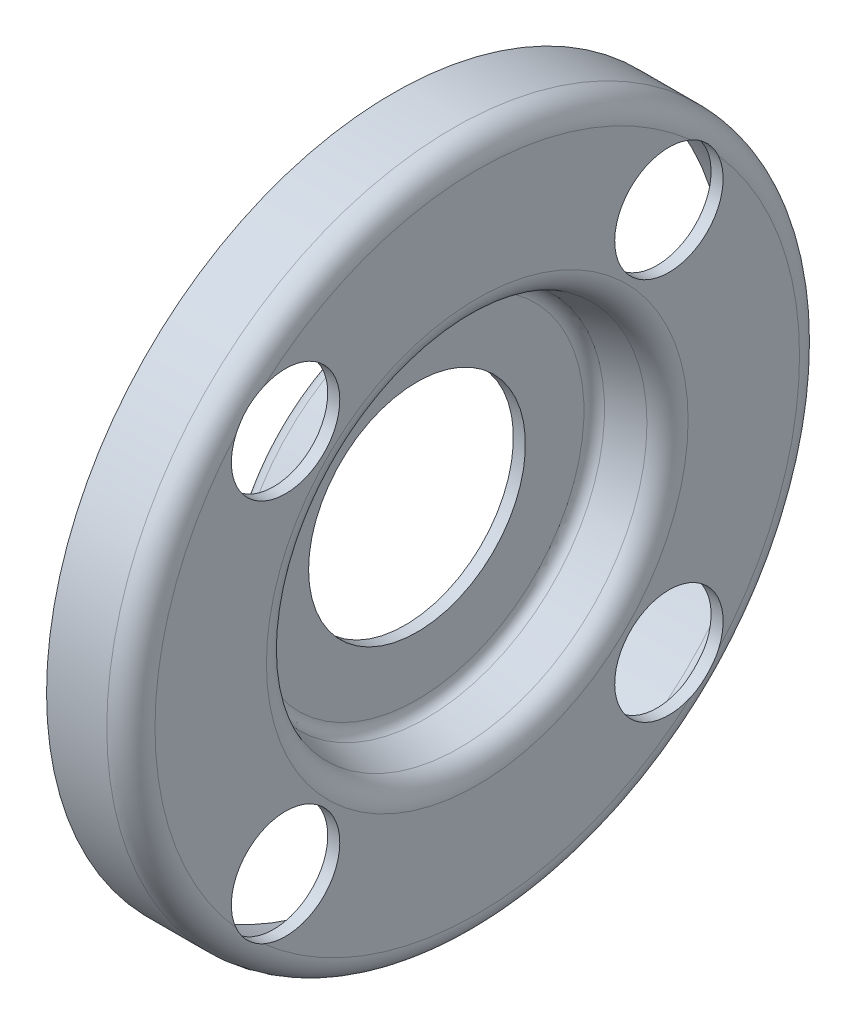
from build123d import *

# Parameters (mm, degrees)
ESQUISSE2_R             = 9
ENL_V_MAT_EXTRU_3_DEPTH = 83.197931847


with BuildPart() as part:
    # Esquisse1 → Base-R_vol.-Mince (revolve)
    with BuildSketch(Plane.XY, mode=Mode.PRIVATE) as base_r_vol_mince_sk:
        with BuildLine():
            Line((0, 18), (0, 27.716546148))
            ThreePointArc((0, 27.716546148), (0.826586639, 30.151591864), (2.96472382, 31.580249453))
            Line((2.96472382, 31.580249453), (8.51763809, 33.068148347))
            ThreePointArc((8.51763809, 33.068148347), (9.586706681, 33.782477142), (10, 35))
            Line((10, 35), (10, 53.5))
            ThreePointArc((10, 53.5), (9.414213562, 54.914213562), (8, 55.5))
            Line((8, 55.5), (-2, 55.5))
            Line((-2, 55.5), (-2, 57.5))
            Line((-2, 57.5), (8, 57.5))
            ThreePointArc((8, 57.5), (10.828427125, 56.328427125), (12, 53.5))
            Line((12, 53.5), (12, 35))
            ThreePointArc((12, 35), (11.173413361, 32.564954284), (9.03527618, 31.136296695))
            Line((9.03527618, 31.136296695), (3.48236191, 29.6483978))
            ThreePointArc((3.48236191, 29.6483978), (2.413293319, 28.934069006), (2, 27.716546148))
            Line((2, 27.716546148), (2, 18))
            Line((2, 18), (0, 18))
        make_face()
    revolve(base_r_vol_mince_sk.sketch.rotate(Axis((0, 0, 0), (1, 0, 0)), 90), axis=Axis((0, 0, 0), (1, 0, 0)))

    # Esquisse2 → Enl_v. mat.-Extru.3 (cut, through all)
    with BuildSketch(Plane(origin=(0, 0, 0), x_dir=(0, 0, -1), z_dir=(1, 0, 0))):
        with Locations(Location((31.819805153, 31.819805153, 0), (0, 0, 65.990157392))):
            Circle(ESQUISSE2_R)
        with Locations(Location((-31.819805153, 31.819805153, 0), (0, 0, 155.990157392))):
            Circle(ESQUISSE2_R)
        with Locations(Location((31.819805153, -31.819805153, 0), (0, 0, 294.009842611))):
            Circle(ESQUISSE2_R)
        with Locations(Location((-31.819805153, -31.819805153, 0), (0, 0, 204.009842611))):
            Circle(ESQUISSE2_R)
    extrude(amount=ENL_V_MAT_EXTRU_3_DEPTH, mode=Mode.SUBTRACT)


solid = part.part
